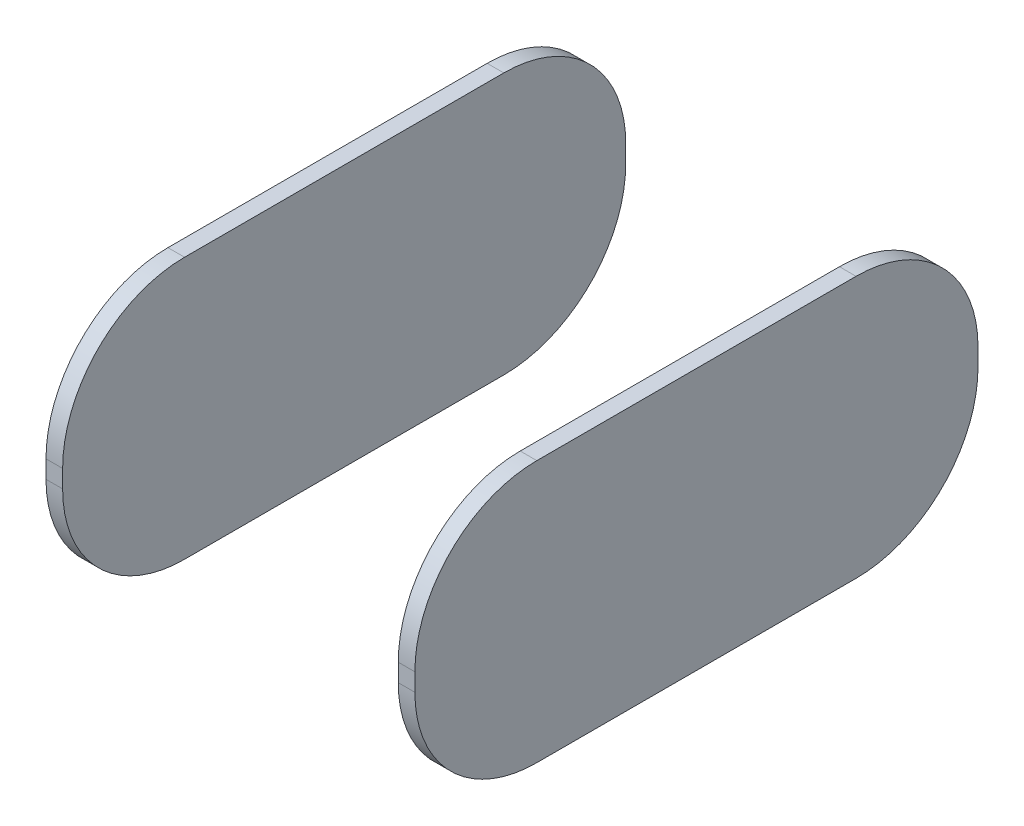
ISO-10303-21;
HEADER;
FILE_DESCRIPTION(('STEP AP214'),'2;1');
FILE_NAME('part.step','',(''),(''),'','','');
FILE_SCHEMA(('AUTOMOTIVE_DESIGN { 1 0 10303 214 1 1 1 1 }'));
ENDSEC;
DATA;
#1=APPLICATION_CONTEXT('core data for automotive mechanical design processes');
#2=APPLICATION_PROTOCOL_DEFINITION('international standard','automotive_design',2000,#1);
#3=PRODUCT_CONTEXT('',#1,'mechanical');
#4=PRODUCT('Part','Part','',(#3));
#5=PRODUCT_RELATED_PRODUCT_CATEGORY('part','',(#4));
#6=PRODUCT_DEFINITION_FORMATION('','',#4);
#7=PRODUCT_DEFINITION_CONTEXT('part definition',#1,'design');
#8=PRODUCT_DEFINITION('design','',#6,#7);
#9=PRODUCT_DEFINITION_SHAPE('','',#8);
#10=(LENGTH_UNIT() NAMED_UNIT(*) SI_UNIT(.MILLI.,.METRE.));
#11=(NAMED_UNIT(*) PLANE_ANGLE_UNIT() SI_UNIT($,.RADIAN.));
#12=(NAMED_UNIT(*) SI_UNIT($,.STERADIAN.) SOLID_ANGLE_UNIT());
#13=UNCERTAINTY_MEASURE_WITH_UNIT(LENGTH_MEASURE(1.E-05),#10,'distance_accuracy_value','');
#14=(GEOMETRIC_REPRESENTATION_CONTEXT(3) GLOBAL_UNCERTAINTY_ASSIGNED_CONTEXT((#13)) GLOBAL_UNIT_ASSIGNED_CONTEXT((#10,
#11,#12)) REPRESENTATION_CONTEXT('',''));
#15=CARTESIAN_POINT('',(0.,0.,0.));
#16=DIRECTION('',(0.,0.,1.));
#17=DIRECTION('',(1.,0.,0.));
#18=AXIS2_PLACEMENT_3D('',#15,#16,#17);
#19=CARTESIAN_POINT('',(7.57,5.9,12.7));
#20=DIRECTION('',(1.,0.,0.));
#21=DIRECTION('',(0.,1.,0.));
#22=AXIS2_PLACEMENT_3D('',#19,#20,#21);
#23=PLANE('',#22);
#24=DIRECTION('',(0.,-1.,0.));
#25=VECTOR('',#24,1.);
#26=CARTESIAN_POINT('',(7.57,5.9,-12.7));
#27=LINE('',#26,#25);
#28=CARTESIAN_POINT('',(7.57,0.400000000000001,-12.7));
#29=VERTEX_POINT('',#28);
#30=CARTESIAN_POINT('',(7.57,-0.400000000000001,-12.7));
#31=VERTEX_POINT('',#30);
#32=EDGE_CURVE('E194',#29,#31,#27,.T.);
#33=ORIENTED_EDGE('',*,*,#32,.T.);
#34=CARTESIAN_POINT('',(7.57,-0.400000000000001,-7.2));
#35=DIRECTION('',(1.,0.,0.));
#36=DIRECTION('',(0.,1.,0.));
#37=AXIS2_PLACEMENT_3D('',#34,#35,#36);
#38=CIRCLE('',#37,5.5);
#39=CARTESIAN_POINT('',(7.57,-5.9,-7.2));
#40=VERTEX_POINT('',#39);
#41=EDGE_CURVE('E168',#31,#40,#38,.F.);
#42=ORIENTED_EDGE('',*,*,#41,.T.);
#43=DIRECTION('',(0.,0.,-1.));
#44=VECTOR('',#43,1.);
#45=CARTESIAN_POINT('',(7.57,-5.9,12.7));
#46=LINE('',#45,#44);
#47=CARTESIAN_POINT('',(7.57,-5.9,7.2));
#48=VERTEX_POINT('',#47);
#49=EDGE_CURVE('E135',#48,#40,#46,.T.);
#50=ORIENTED_EDGE('',*,*,#49,.F.);
#51=CARTESIAN_POINT('',(7.57,-0.400000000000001,7.2));
#52=DIRECTION('',(1.,0.,0.));
#53=DIRECTION('',(0.,1.,0.));
#54=AXIS2_PLACEMENT_3D('',#51,#52,#53);
#55=CIRCLE('',#54,5.5);
#56=CARTESIAN_POINT('',(7.57,-0.400000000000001,12.7));
#57=VERTEX_POINT('',#56);
#58=EDGE_CURVE('E140',#48,#57,#55,.F.);
#59=ORIENTED_EDGE('',*,*,#58,.T.);
#60=DIRECTION('',(0.,-1.,0.));
#61=VECTOR('',#60,1.);
#62=CARTESIAN_POINT('',(7.57,5.9,12.7));
#63=LINE('',#62,#61);
#64=CARTESIAN_POINT('',(7.57,0.400000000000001,12.7));
#65=VERTEX_POINT('',#64);
#66=EDGE_CURVE('E182',#65,#57,#63,.T.);
#67=ORIENTED_EDGE('',*,*,#66,.F.);
#68=CARTESIAN_POINT('',(7.57,0.400000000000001,7.2));
#69=DIRECTION('',(1.,0.,0.));
#70=DIRECTION('',(0.,1.,0.));
#71=AXIS2_PLACEMENT_3D('',#68,#69,#70);
#72=CIRCLE('',#71,5.5);
#73=CARTESIAN_POINT('',(7.57,5.9,7.2));
#74=VERTEX_POINT('',#73);
#75=EDGE_CURVE('E69',#65,#74,#72,.F.);
#76=ORIENTED_EDGE('',*,*,#75,.T.);
#77=DIRECTION('',(0.,0.,-1.));
#78=VECTOR('',#77,1.);
#79=CARTESIAN_POINT('',(7.57,5.9,12.7));
#80=LINE('',#79,#78);
#81=CARTESIAN_POINT('',(7.57,5.9,-7.2));
#82=VERTEX_POINT('',#81);
#83=EDGE_CURVE('E190',#74,#82,#80,.T.);
#84=ORIENTED_EDGE('',*,*,#83,.T.);
#85=CARTESIAN_POINT('',(7.57,0.400000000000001,-7.2));
#86=DIRECTION('',(1.,0.,0.));
#87=DIRECTION('',(0.,1.,0.));
#88=AXIS2_PLACEMENT_3D('',#85,#86,#87);
#89=CIRCLE('',#88,5.5);
#90=EDGE_CURVE('E61',#82,#29,#89,.F.);
#91=ORIENTED_EDGE('',*,*,#90,.T.);
#92=EDGE_LOOP('',(#33,#42,#50,#59,#67,#76,#84,#91));
#93=FACE_BOUND('',#92,.T.);
#94=ADVANCED_FACE('F46',(#93),#23,.F.);
#95=CARTESIAN_POINT('',(7.57,-5.9,12.7));
#96=DIRECTION('',(0.,1.,0.));
#97=DIRECTION('',(0.,0.,1.));
#98=AXIS2_PLACEMENT_3D('',#95,#96,#97);
#99=PLANE('',#98);
#100=ORIENTED_EDGE('',*,*,#49,.T.);
#101=DIRECTION('',(1.,0.,0.));
#102=VECTOR('',#101,1.);
#103=CARTESIAN_POINT('',(7.57,-5.9,-7.2));
#104=LINE('',#103,#102);
#105=CARTESIAN_POINT('',(8.32,-5.9,-7.2));
#106=VERTEX_POINT('',#105);
#107=EDGE_CURVE('E133',#40,#106,#104,.T.);
#108=ORIENTED_EDGE('',*,*,#107,.T.);
#109=DIRECTION('',(0.,0.,-1.));
#110=VECTOR('',#109,1.);
#111=CARTESIAN_POINT('',(8.32,-5.9,12.7));
#112=LINE('',#111,#110);
#113=CARTESIAN_POINT('',(8.32,-5.9,7.2));
#114=VERTEX_POINT('',#113);
#115=EDGE_CURVE('E116',#114,#106,#112,.T.);
#116=ORIENTED_EDGE('',*,*,#115,.F.);
#117=DIRECTION('',(1.,0.,0.));
#118=VECTOR('',#117,1.);
#119=CARTESIAN_POINT('',(7.57,-5.9,7.2));
#120=LINE('',#119,#118);
#121=EDGE_CURVE('E130',#114,#48,#120,.F.);
#122=ORIENTED_EDGE('',*,*,#121,.T.);
#123=EDGE_LOOP('',(#100,#108,#116,#122));
#124=FACE_BOUND('',#123,.T.);
#125=ADVANCED_FACE('F129',(#124),#99,.F.);
#126=CARTESIAN_POINT('',(8.32,5.9,12.7));
#127=DIRECTION('',(-1.,0.,0.));
#128=DIRECTION('',(0.,-1.,0.));
#129=AXIS2_PLACEMENT_3D('',#126,#127,#128);
#130=PLANE('',#129);
#131=ORIENTED_EDGE('',*,*,#115,.T.);
#132=CARTESIAN_POINT('',(8.32,-0.400000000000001,-7.2));
#133=DIRECTION('',(-1.,0.,0.));
#134=DIRECTION('',(0.,-1.,0.));
#135=AXIS2_PLACEMENT_3D('',#132,#133,#134);
#136=CIRCLE('',#135,5.5);
#137=CARTESIAN_POINT('',(8.32,-0.400000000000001,-12.7));
#138=VERTEX_POINT('',#137);
#139=EDGE_CURVE('E154',#106,#138,#136,.F.);
#140=ORIENTED_EDGE('',*,*,#139,.T.);
#141=DIRECTION('',(0.,1.,0.));
#142=VECTOR('',#141,1.);
#143=CARTESIAN_POINT('',(8.32,5.9,-12.7));
#144=LINE('',#143,#142);
#145=CARTESIAN_POINT('',(8.32,0.400000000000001,-12.7));
#146=VERTEX_POINT('',#145);
#147=EDGE_CURVE('E187',#138,#146,#144,.T.);
#148=ORIENTED_EDGE('',*,*,#147,.T.);
#149=CARTESIAN_POINT('',(8.32,0.400000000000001,-7.2));
#150=DIRECTION('',(-1.,0.,0.));
#151=DIRECTION('',(0.,-1.,0.));
#152=AXIS2_PLACEMENT_3D('',#149,#150,#151);
#153=CIRCLE('',#152,5.5);
#154=CARTESIAN_POINT('',(8.32,5.9,-7.2));
#155=VERTEX_POINT('',#154);
#156=EDGE_CURVE('E123',#146,#155,#153,.F.);
#157=ORIENTED_EDGE('',*,*,#156,.T.);
#158=DIRECTION('',(0.,0.,-1.));
#159=VECTOR('',#158,1.);
#160=CARTESIAN_POINT('',(8.32,5.9,12.7));
#161=LINE('',#160,#159);
#162=CARTESIAN_POINT('',(8.32,5.9,7.2));
#163=VERTEX_POINT('',#162);
#164=EDGE_CURVE('E136',#163,#155,#161,.T.);
#165=ORIENTED_EDGE('',*,*,#164,.F.);
#166=CARTESIAN_POINT('',(8.32,0.400000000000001,7.2));
#167=DIRECTION('',(-1.,0.,0.));
#168=DIRECTION('',(0.,-1.,0.));
#169=AXIS2_PLACEMENT_3D('',#166,#167,#168);
#170=CIRCLE('',#169,5.5);
#171=CARTESIAN_POINT('',(8.32,0.400000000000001,12.7));
#172=VERTEX_POINT('',#171);
#173=EDGE_CURVE('E124',#163,#172,#170,.F.);
#174=ORIENTED_EDGE('',*,*,#173,.T.);
#175=DIRECTION('',(0.,1.,0.));
#176=VECTOR('',#175,1.);
#177=CARTESIAN_POINT('',(8.32,5.9,12.7));
#178=LINE('',#177,#176);
#179=CARTESIAN_POINT('',(8.32,-0.400000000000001,12.7));
#180=VERTEX_POINT('',#179);
#181=EDGE_CURVE('E118',#180,#172,#178,.T.);
#182=ORIENTED_EDGE('',*,*,#181,.F.);
#183=CARTESIAN_POINT('',(8.32,-0.400000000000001,7.2));
#184=DIRECTION('',(-1.,0.,0.));
#185=DIRECTION('',(0.,-1.,0.));
#186=AXIS2_PLACEMENT_3D('',#183,#184,#185);
#187=CIRCLE('',#186,5.5);
#188=EDGE_CURVE('E113',#180,#114,#187,.F.);
#189=ORIENTED_EDGE('',*,*,#188,.T.);
#190=EDGE_LOOP('',(#131,#140,#148,#157,#165,#174,#182,#189));
#191=FACE_BOUND('',#190,.T.);
#192=ADVANCED_FACE('F115',(#191),#130,.F.);
#193=CARTESIAN_POINT('',(7.57,5.9,12.7));
#194=DIRECTION('',(0.,-1.,0.));
#195=DIRECTION('',(0.,0.,-1.));
#196=AXIS2_PLACEMENT_3D('',#193,#194,#195);
#197=PLANE('',#196);
#198=ORIENTED_EDGE('',*,*,#164,.T.);
#199=DIRECTION('',(-1.,0.,0.));
#200=VECTOR('',#199,1.);
#201=CARTESIAN_POINT('',(7.57,5.9,-7.2));
#202=LINE('',#201,#200);
#203=EDGE_CURVE('E174',#155,#82,#202,.T.);
#204=ORIENTED_EDGE('',*,*,#203,.T.);
#205=ORIENTED_EDGE('',*,*,#83,.F.);
#206=DIRECTION('',(-1.,0.,0.));
#207=VECTOR('',#206,1.);
#208=CARTESIAN_POINT('',(8.32,5.9,7.2));
#209=LINE('',#208,#207);
#210=EDGE_CURVE('E171',#74,#163,#209,.F.);
#211=ORIENTED_EDGE('',*,*,#210,.T.);
#212=EDGE_LOOP('',(#198,#204,#205,#211));
#213=FACE_BOUND('',#212,.T.);
#214=ADVANCED_FACE('F203',(#213),#197,.F.);
#215=CARTESIAN_POINT('',(7.57,-5.9,12.7));
#216=DIRECTION('',(0.,0.,1.));
#217=DIRECTION('',(1.,0.,0.));
#218=AXIS2_PLACEMENT_3D('',#215,#216,#217);
#219=PLANE('',#218);
#220=ORIENTED_EDGE('',*,*,#66,.T.);
#221=DIRECTION('',(1.,0.,0.));
#222=VECTOR('',#221,1.);
#223=CARTESIAN_POINT('',(8.32,-0.400000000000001,12.7));
#224=LINE('',#223,#222);
#225=EDGE_CURVE('E12',#57,#180,#224,.T.);
#226=ORIENTED_EDGE('',*,*,#225,.T.);
#227=ORIENTED_EDGE('',*,*,#181,.T.);
#228=DIRECTION('',(-1.,0.,0.));
#229=VECTOR('',#228,1.);
#230=CARTESIAN_POINT('',(7.57,0.400000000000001,12.7));
#231=LINE('',#230,#229);
#232=EDGE_CURVE('E54',#172,#65,#231,.T.);
#233=ORIENTED_EDGE('',*,*,#232,.T.);
#234=EDGE_LOOP('',(#220,#226,#227,#233));
#235=FACE_BOUND('',#234,.T.);
#236=ADVANCED_FACE('F181',(#235),#219,.T.);
#237=CARTESIAN_POINT('',(7.57,-5.9,-12.7));
#238=DIRECTION('',(0.,0.,1.));
#239=DIRECTION('',(1.,0.,0.));
#240=AXIS2_PLACEMENT_3D('',#237,#238,#239);
#241=PLANE('',#240);
#242=ORIENTED_EDGE('',*,*,#147,.F.);
#243=DIRECTION('',(1.,0.,0.));
#244=VECTOR('',#243,1.);
#245=CARTESIAN_POINT('',(7.57,-0.400000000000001,-12.7));
#246=LINE('',#245,#244);
#247=EDGE_CURVE('E159',#138,#31,#246,.F.);
#248=ORIENTED_EDGE('',*,*,#247,.T.);
#249=ORIENTED_EDGE('',*,*,#32,.F.);
#250=DIRECTION('',(-1.,0.,0.));
#251=VECTOR('',#250,1.);
#252=CARTESIAN_POINT('',(7.57,0.400000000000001,-12.7));
#253=LINE('',#252,#251);
#254=EDGE_CURVE('E157',#29,#146,#253,.F.);
#255=ORIENTED_EDGE('',*,*,#254,.T.);
#256=EDGE_LOOP('',(#242,#248,#249,#255));
#257=FACE_BOUND('',#256,.T.);
#258=ADVANCED_FACE('F210',(#257),#241,.F.);
#259=CARTESIAN_POINT('',(7.57,-0.400000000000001,-7.2));
#260=DIRECTION('',(1.,0.,0.));
#261=DIRECTION('',(0.,0.,-1.));
#262=AXIS2_PLACEMENT_3D('',#259,#260,#261);
#263=CYLINDRICAL_SURFACE('',#262,5.5);
#264=ORIENTED_EDGE('',*,*,#41,.F.);
#265=ORIENTED_EDGE('',*,*,#247,.F.);
#266=ORIENTED_EDGE('',*,*,#139,.F.);
#267=ORIENTED_EDGE('',*,*,#107,.F.);
#268=EDGE_LOOP('',(#264,#265,#266,#267));
#269=FACE_BOUND('',#268,.T.);
#270=ADVANCED_FACE('F214',(#269),#263,.T.);
#271=CARTESIAN_POINT('',(7.57,0.400000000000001,-7.2));
#272=DIRECTION('',(-1.,0.,0.));
#273=DIRECTION('',(0.,0.,1.));
#274=AXIS2_PLACEMENT_3D('',#271,#272,#273);
#275=CYLINDRICAL_SURFACE('',#274,5.5);
#276=ORIENTED_EDGE('',*,*,#156,.F.);
#277=ORIENTED_EDGE('',*,*,#254,.F.);
#278=ORIENTED_EDGE('',*,*,#90,.F.);
#279=ORIENTED_EDGE('',*,*,#203,.F.);
#280=EDGE_LOOP('',(#276,#277,#278,#279));
#281=FACE_BOUND('',#280,.T.);
#282=ADVANCED_FACE('F206',(#281),#275,.T.);
#283=CARTESIAN_POINT('',(7.57,-0.400000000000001,7.2));
#284=DIRECTION('',(-1.,0.,0.));
#285=DIRECTION('',(0.,0.,1.));
#286=AXIS2_PLACEMENT_3D('',#283,#284,#285);
#287=CYLINDRICAL_SURFACE('',#286,5.5);
#288=ORIENTED_EDGE('',*,*,#58,.F.);
#289=ORIENTED_EDGE('',*,*,#121,.F.);
#290=ORIENTED_EDGE('',*,*,#188,.F.);
#291=ORIENTED_EDGE('',*,*,#225,.F.);
#292=EDGE_LOOP('',(#288,#289,#290,#291));
#293=FACE_BOUND('',#292,.T.);
#294=ADVANCED_FACE('F139',(#293),#287,.T.);
#295=CARTESIAN_POINT('',(7.57,0.400000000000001,7.2));
#296=DIRECTION('',(1.,0.,0.));
#297=DIRECTION('',(0.,0.,-1.));
#298=AXIS2_PLACEMENT_3D('',#295,#296,#297);
#299=CYLINDRICAL_SURFACE('',#298,5.5);
#300=ORIENTED_EDGE('',*,*,#173,.F.);
#301=ORIENTED_EDGE('',*,*,#210,.F.);
#302=ORIENTED_EDGE('',*,*,#75,.F.);
#303=ORIENTED_EDGE('',*,*,#232,.F.);
#304=EDGE_LOOP('',(#300,#301,#302,#303));
#305=FACE_BOUND('',#304,.T.);
#306=ADVANCED_FACE('F216',(#305),#299,.T.);
#307=CLOSED_SHELL('',(#94,#125,#192,#214,#236,#258,#270,#282,#294,#306));
#308=MANIFOLD_SOLID_BREP('B2',#307);
#309=CARTESIAN_POINT('',(-8.32,5.9,12.7));
#310=DIRECTION('',(1.,0.,0.));
#311=DIRECTION('',(0.,1.,0.));
#312=AXIS2_PLACEMENT_3D('',#309,#310,#311);
#313=PLANE('',#312);
#314=DIRECTION('',(0.,-1.,0.));
#315=VECTOR('',#314,1.);
#316=CARTESIAN_POINT('',(-8.32,5.9,-12.7));
#317=LINE('',#316,#315);
#318=CARTESIAN_POINT('',(-8.32,0.400000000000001,-12.7));
#319=VERTEX_POINT('',#318);
#320=CARTESIAN_POINT('',(-8.32,-0.400000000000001,-12.7));
#321=VERTEX_POINT('',#320);
#322=EDGE_CURVE('E454',#319,#321,#317,.T.);
#323=ORIENTED_EDGE('',*,*,#322,.T.);
#324=CARTESIAN_POINT('',(-8.32,-0.400000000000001,-7.2));
#325=DIRECTION('',(1.,0.,0.));
#326=DIRECTION('',(0.,1.,0.));
#327=AXIS2_PLACEMENT_3D('',#324,#325,#326);
#328=CIRCLE('',#327,5.5);
#329=CARTESIAN_POINT('',(-8.32,-5.9,-7.2));
#330=VERTEX_POINT('',#329);
#331=EDGE_CURVE('E430',#321,#330,#328,.F.);
#332=ORIENTED_EDGE('',*,*,#331,.T.);
#333=DIRECTION('',(0.,0.,-1.));
#334=VECTOR('',#333,1.);
#335=CARTESIAN_POINT('',(-8.32,-5.9,12.7));
#336=LINE('',#335,#334);
#337=CARTESIAN_POINT('',(-8.32,-5.9,7.2));
#338=VERTEX_POINT('',#337);
#339=EDGE_CURVE('E396',#338,#330,#336,.T.);
#340=ORIENTED_EDGE('',*,*,#339,.F.);
#341=CARTESIAN_POINT('',(-8.32,-0.400000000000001,7.2));
#342=DIRECTION('',(1.,0.,0.));
#343=DIRECTION('',(0.,1.,0.));
#344=AXIS2_PLACEMENT_3D('',#341,#342,#343);
#345=CIRCLE('',#344,5.5);
#346=CARTESIAN_POINT('',(-8.32,-0.400000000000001,12.7));
#347=VERTEX_POINT('',#346);
#348=EDGE_CURVE('E401',#338,#347,#345,.F.);
#349=ORIENTED_EDGE('',*,*,#348,.T.);
#350=DIRECTION('',(0.,-1.,0.));
#351=VECTOR('',#350,1.);
#352=CARTESIAN_POINT('',(-8.32,5.9,12.7));
#353=LINE('',#352,#351);
#354=CARTESIAN_POINT('',(-8.32,0.400000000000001,12.7));
#355=VERTEX_POINT('',#354);
#356=EDGE_CURVE('E442',#355,#347,#353,.T.);
#357=ORIENTED_EDGE('',*,*,#356,.F.);
#358=CARTESIAN_POINT('',(-8.32,0.400000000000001,7.2));
#359=DIRECTION('',(1.,0.,0.));
#360=DIRECTION('',(0.,1.,0.));
#361=AXIS2_PLACEMENT_3D('',#358,#359,#360);
#362=CIRCLE('',#361,5.5);
#363=CARTESIAN_POINT('',(-8.32,5.9,7.2));
#364=VERTEX_POINT('',#363);
#365=EDGE_CURVE('E330',#355,#364,#362,.F.);
#366=ORIENTED_EDGE('',*,*,#365,.T.);
#367=DIRECTION('',(0.,0.,-1.));
#368=VECTOR('',#367,1.);
#369=CARTESIAN_POINT('',(-8.32,5.9,12.7));
#370=LINE('',#369,#368);
#371=CARTESIAN_POINT('',(-8.32,5.9,-7.2));
#372=VERTEX_POINT('',#371);
#373=EDGE_CURVE('E450',#364,#372,#370,.T.);
#374=ORIENTED_EDGE('',*,*,#373,.T.);
#375=CARTESIAN_POINT('',(-8.32,0.400000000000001,-7.2));
#376=DIRECTION('',(1.,0.,0.));
#377=DIRECTION('',(0.,1.,0.));
#378=AXIS2_PLACEMENT_3D('',#375,#376,#377);
#379=CIRCLE('',#378,5.5);
#380=EDGE_CURVE('E322',#372,#319,#379,.F.);
#381=ORIENTED_EDGE('',*,*,#380,.T.);
#382=EDGE_LOOP('',(#323,#332,#340,#349,#357,#366,#374,#381));
#383=FACE_BOUND('',#382,.T.);
#384=ADVANCED_FACE('F307',(#383),#313,.F.);
#385=CARTESIAN_POINT('',(-8.32,-5.9,12.7));
#386=DIRECTION('',(0.,1.,0.));
#387=DIRECTION('',(0.,0.,1.));
#388=AXIS2_PLACEMENT_3D('',#385,#386,#387);
#389=PLANE('',#388);
#390=ORIENTED_EDGE('',*,*,#339,.T.);
#391=DIRECTION('',(1.,0.,0.));
#392=VECTOR('',#391,1.);
#393=CARTESIAN_POINT('',(-8.32,-5.9,-7.2));
#394=LINE('',#393,#392);
#395=CARTESIAN_POINT('',(-7.57,-5.9,-7.2));
#396=VERTEX_POINT('',#395);
#397=EDGE_CURVE('E394',#330,#396,#394,.T.);
#398=ORIENTED_EDGE('',*,*,#397,.T.);
#399=DIRECTION('',(0.,0.,-1.));
#400=VECTOR('',#399,1.);
#401=CARTESIAN_POINT('',(-7.57,-5.9,12.7));
#402=LINE('',#401,#400);
#403=CARTESIAN_POINT('',(-7.57,-5.9,7.2));
#404=VERTEX_POINT('',#403);
#405=EDGE_CURVE('E377',#404,#396,#402,.T.);
#406=ORIENTED_EDGE('',*,*,#405,.F.);
#407=DIRECTION('',(1.,0.,0.));
#408=VECTOR('',#407,1.);
#409=CARTESIAN_POINT('',(-8.32,-5.9,7.2));
#410=LINE('',#409,#408);
#411=EDGE_CURVE('E391',#404,#338,#410,.F.);
#412=ORIENTED_EDGE('',*,*,#411,.T.);
#413=EDGE_LOOP('',(#390,#398,#406,#412));
#414=FACE_BOUND('',#413,.T.);
#415=ADVANCED_FACE('F390',(#414),#389,.F.);
#416=CARTESIAN_POINT('',(-7.57,5.9,12.7));
#417=DIRECTION('',(-1.,0.,0.));
#418=DIRECTION('',(0.,-1.,0.));
#419=AXIS2_PLACEMENT_3D('',#416,#417,#418);
#420=PLANE('',#419);
#421=ORIENTED_EDGE('',*,*,#405,.T.);
#422=CARTESIAN_POINT('',(-7.57,-0.400000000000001,-7.2));
#423=DIRECTION('',(-1.,0.,0.));
#424=DIRECTION('',(0.,-1.,0.));
#425=AXIS2_PLACEMENT_3D('',#422,#423,#424);
#426=CIRCLE('',#425,5.5);
#427=CARTESIAN_POINT('',(-7.57,-0.400000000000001,-12.7));
#428=VERTEX_POINT('',#427);
#429=EDGE_CURVE('E415',#396,#428,#426,.F.);
#430=ORIENTED_EDGE('',*,*,#429,.T.);
#431=DIRECTION('',(0.,1.,0.));
#432=VECTOR('',#431,1.);
#433=CARTESIAN_POINT('',(-7.57,5.9,-12.7));
#434=LINE('',#433,#432);
#435=CARTESIAN_POINT('',(-7.57,0.400000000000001,-12.7));
#436=VERTEX_POINT('',#435);
#437=EDGE_CURVE('E447',#428,#436,#434,.T.);
#438=ORIENTED_EDGE('',*,*,#437,.T.);
#439=CARTESIAN_POINT('',(-7.57,0.400000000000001,-7.2));
#440=DIRECTION('',(-1.,0.,0.));
#441=DIRECTION('',(0.,-1.,0.));
#442=AXIS2_PLACEMENT_3D('',#439,#440,#441);
#443=CIRCLE('',#442,5.5);
#444=CARTESIAN_POINT('',(-7.57,5.9,-7.2));
#445=VERTEX_POINT('',#444);
#446=EDGE_CURVE('E384',#436,#445,#443,.F.);
#447=ORIENTED_EDGE('',*,*,#446,.T.);
#448=DIRECTION('',(0.,0.,-1.));
#449=VECTOR('',#448,1.);
#450=CARTESIAN_POINT('',(-7.57,5.9,12.7));
#451=LINE('',#450,#449);
#452=CARTESIAN_POINT('',(-7.57,5.9,7.2));
#453=VERTEX_POINT('',#452);
#454=EDGE_CURVE('E397',#453,#445,#451,.T.);
#455=ORIENTED_EDGE('',*,*,#454,.F.);
#456=CARTESIAN_POINT('',(-7.57,0.400000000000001,7.2));
#457=DIRECTION('',(-1.,0.,0.));
#458=DIRECTION('',(0.,-1.,0.));
#459=AXIS2_PLACEMENT_3D('',#456,#457,#458);
#460=CIRCLE('',#459,5.5);
#461=CARTESIAN_POINT('',(-7.57,0.400000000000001,12.7));
#462=VERTEX_POINT('',#461);
#463=EDGE_CURVE('E385',#453,#462,#460,.F.);
#464=ORIENTED_EDGE('',*,*,#463,.T.);
#465=DIRECTION('',(0.,1.,0.));
#466=VECTOR('',#465,1.);
#467=CARTESIAN_POINT('',(-7.57,5.9,12.7));
#468=LINE('',#467,#466);
#469=CARTESIAN_POINT('',(-7.57,-0.400000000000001,12.7));
#470=VERTEX_POINT('',#469);
#471=EDGE_CURVE('E379',#470,#462,#468,.T.);
#472=ORIENTED_EDGE('',*,*,#471,.F.);
#473=CARTESIAN_POINT('',(-7.57,-0.400000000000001,7.2));
#474=DIRECTION('',(-1.,0.,0.));
#475=DIRECTION('',(0.,-1.,0.));
#476=AXIS2_PLACEMENT_3D('',#473,#474,#475);
#477=CIRCLE('',#476,5.5);
#478=EDGE_CURVE('E374',#470,#404,#477,.F.);
#479=ORIENTED_EDGE('',*,*,#478,.T.);
#480=EDGE_LOOP('',(#421,#430,#438,#447,#455,#464,#472,#479));
#481=FACE_BOUND('',#480,.T.);
#482=ADVANCED_FACE('F376',(#481),#420,.F.);
#483=CARTESIAN_POINT('',(-8.32,5.9,12.7));
#484=DIRECTION('',(0.,-1.,0.));
#485=DIRECTION('',(0.,0.,-1.));
#486=AXIS2_PLACEMENT_3D('',#483,#484,#485);
#487=PLANE('',#486);
#488=ORIENTED_EDGE('',*,*,#454,.T.);
#489=DIRECTION('',(-1.,0.,0.));
#490=VECTOR('',#489,1.);
#491=CARTESIAN_POINT('',(-8.32,5.9,-7.2));
#492=LINE('',#491,#490);
#493=EDGE_CURVE('E434',#445,#372,#492,.T.);
#494=ORIENTED_EDGE('',*,*,#493,.T.);
#495=ORIENTED_EDGE('',*,*,#373,.F.);
#496=DIRECTION('',(-1.,0.,0.));
#497=VECTOR('',#496,1.);
#498=CARTESIAN_POINT('',(-7.57,5.9,7.2));
#499=LINE('',#498,#497);
#500=EDGE_CURVE('E432',#364,#453,#499,.F.);
#501=ORIENTED_EDGE('',*,*,#500,.T.);
#502=EDGE_LOOP('',(#488,#494,#495,#501));
#503=FACE_BOUND('',#502,.T.);
#504=ADVANCED_FACE('F464',(#503),#487,.F.);
#505=CARTESIAN_POINT('',(-8.32,-5.9,12.7));
#506=DIRECTION('',(0.,0.,1.));
#507=DIRECTION('',(1.,0.,0.));
#508=AXIS2_PLACEMENT_3D('',#505,#506,#507);
#509=PLANE('',#508);
#510=ORIENTED_EDGE('',*,*,#356,.T.);
#511=DIRECTION('',(1.,0.,0.));
#512=VECTOR('',#511,1.);
#513=CARTESIAN_POINT('',(-7.57,-0.400000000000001,12.7));
#514=LINE('',#513,#512);
#515=EDGE_CURVE('E44',#347,#470,#514,.T.);
#516=ORIENTED_EDGE('',*,*,#515,.T.);
#517=ORIENTED_EDGE('',*,*,#471,.T.);
#518=DIRECTION('',(-1.,0.,0.));
#519=VECTOR('',#518,1.);
#520=CARTESIAN_POINT('',(-8.32,0.400000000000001,12.7));
#521=LINE('',#520,#519);
#522=EDGE_CURVE('E315',#462,#355,#521,.T.);
#523=ORIENTED_EDGE('',*,*,#522,.T.);
#524=EDGE_LOOP('',(#510,#516,#517,#523));
#525=FACE_BOUND('',#524,.T.);
#526=ADVANCED_FACE('F441',(#525),#509,.T.);
#527=CARTESIAN_POINT('',(-8.32,-5.9,-12.7));
#528=DIRECTION('',(0.,0.,1.));
#529=DIRECTION('',(1.,0.,0.));
#530=AXIS2_PLACEMENT_3D('',#527,#528,#529);
#531=PLANE('',#530);
#532=ORIENTED_EDGE('',*,*,#437,.F.);
#533=DIRECTION('',(1.,0.,0.));
#534=VECTOR('',#533,1.);
#535=CARTESIAN_POINT('',(-8.32,-0.400000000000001,-12.7));
#536=LINE('',#535,#534);
#537=EDGE_CURVE('E421',#428,#321,#536,.F.);
#538=ORIENTED_EDGE('',*,*,#537,.T.);
#539=ORIENTED_EDGE('',*,*,#322,.F.);
#540=DIRECTION('',(-1.,0.,0.));
#541=VECTOR('',#540,1.);
#542=CARTESIAN_POINT('',(-8.32,0.400000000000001,-12.7));
#543=LINE('',#542,#541);
#544=EDGE_CURVE('E418',#319,#436,#543,.F.);
#545=ORIENTED_EDGE('',*,*,#544,.T.);
#546=EDGE_LOOP('',(#532,#538,#539,#545));
#547=FACE_BOUND('',#546,.T.);
#548=ADVANCED_FACE('F471',(#547),#531,.F.);
#549=CARTESIAN_POINT('',(-8.32,-0.400000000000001,-7.2));
#550=DIRECTION('',(1.,0.,0.));
#551=DIRECTION('',(0.,0.,-1.));
#552=AXIS2_PLACEMENT_3D('',#549,#550,#551);
#553=CYLINDRICAL_SURFACE('',#552,5.5);
#554=ORIENTED_EDGE('',*,*,#331,.F.);
#555=ORIENTED_EDGE('',*,*,#537,.F.);
#556=ORIENTED_EDGE('',*,*,#429,.F.);
#557=ORIENTED_EDGE('',*,*,#397,.F.);
#558=EDGE_LOOP('',(#554,#555,#556,#557));
#559=FACE_BOUND('',#558,.T.);
#560=ADVANCED_FACE('F475',(#559),#553,.T.);
#561=CARTESIAN_POINT('',(-8.32,0.400000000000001,-7.2));
#562=DIRECTION('',(-1.,0.,0.));
#563=DIRECTION('',(0.,0.,1.));
#564=AXIS2_PLACEMENT_3D('',#561,#562,#563);
#565=CYLINDRICAL_SURFACE('',#564,5.5);
#566=ORIENTED_EDGE('',*,*,#446,.F.);
#567=ORIENTED_EDGE('',*,*,#544,.F.);
#568=ORIENTED_EDGE('',*,*,#380,.F.);
#569=ORIENTED_EDGE('',*,*,#493,.F.);
#570=EDGE_LOOP('',(#566,#567,#568,#569));
#571=FACE_BOUND('',#570,.T.);
#572=ADVANCED_FACE('F467',(#571),#565,.T.);
#573=CARTESIAN_POINT('',(-8.32,-0.400000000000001,7.2));
#574=DIRECTION('',(-1.,0.,0.));
#575=DIRECTION('',(0.,0.,1.));
#576=AXIS2_PLACEMENT_3D('',#573,#574,#575);
#577=CYLINDRICAL_SURFACE('',#576,5.5);
#578=ORIENTED_EDGE('',*,*,#348,.F.);
#579=ORIENTED_EDGE('',*,*,#411,.F.);
#580=ORIENTED_EDGE('',*,*,#478,.F.);
#581=ORIENTED_EDGE('',*,*,#515,.F.);
#582=EDGE_LOOP('',(#578,#579,#580,#581));
#583=FACE_BOUND('',#582,.T.);
#584=ADVANCED_FACE('F400',(#583),#577,.T.);
#585=CARTESIAN_POINT('',(-8.32,0.400000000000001,7.2));
#586=DIRECTION('',(1.,0.,0.));
#587=DIRECTION('',(0.,0.,-1.));
#588=AXIS2_PLACEMENT_3D('',#585,#586,#587);
#589=CYLINDRICAL_SURFACE('',#588,5.5);
#590=ORIENTED_EDGE('',*,*,#463,.F.);
#591=ORIENTED_EDGE('',*,*,#500,.F.);
#592=ORIENTED_EDGE('',*,*,#365,.F.);
#593=ORIENTED_EDGE('',*,*,#522,.F.);
#594=EDGE_LOOP('',(#590,#591,#592,#593));
#595=FACE_BOUND('',#594,.T.);
#596=ADVANCED_FACE('F477',(#595),#589,.T.);
#597=CLOSED_SHELL('',(#384,#415,#482,#504,#526,#548,#560,#572,#584,#596));
#598=MANIFOLD_SOLID_BREP('B6',#597);
#599=ADVANCED_BREP_SHAPE_REPRESENTATION('',(#18,#308,#598),#14);
#600=SHAPE_DEFINITION_REPRESENTATION(#9,#599);
ENDSEC;
END-ISO-10303-21;
